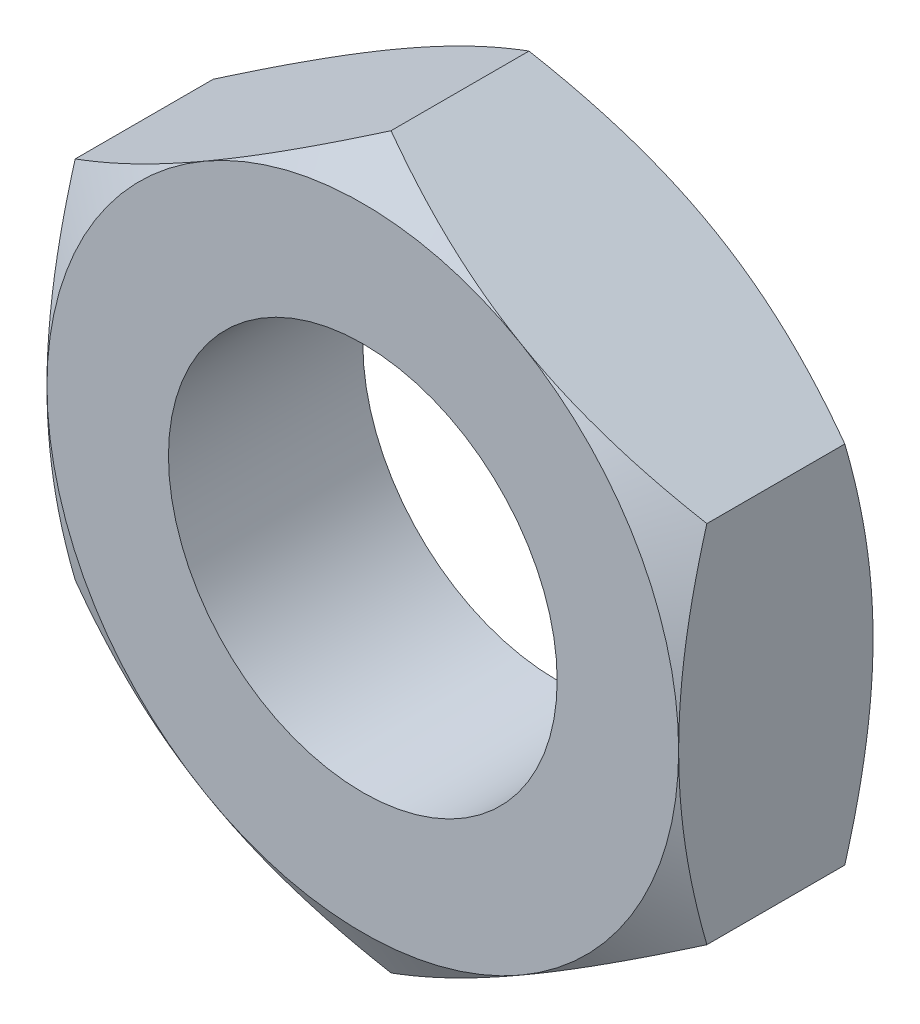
from build123d import *

# Parameters (mm, degrees)
BASE_EXTRUSION_DEPTH    = 4
ESQUISSE3_R             = 4
ENL_V_MAT_EXTRU_1_DEPTH = 11.704360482


with BuildPart() as part:
    # Esquisse1 → Base-Extrusion (new body)
    with BuildSketch(Plane.XY):
        Polygon((6.5, -3.75277675), (6.5, 3.75277675), (0, 7.505553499), (-6.5, 3.75277675), (-6.5, -3.75277675), (0, -7.505553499), align=None)
    extrude(amount=-BASE_EXTRUSION_DEPTH)

    # Esquisse2 → Enl_vement de mati_re-R_volution1 (revolve, cut)
    with BuildSketch(Plane(origin=(0, 0, 0), x_dir=(1, 0, 0), z_dir=(0, 1, 0)), mode=Mode.PRIVATE) as enl_vement_de_mati_re_r_volution1_sk:
        Polygon((-6.5, 0), (-10.964101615, 0), (-10.964101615, 4), (-6.5, 4), (-9.964101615, 2), align=None)
    revolve(enl_vement_de_mati_re_r_volution1_sk.sketch.rotate(Axis((0, 0, -4), (0, 0, 1)), 180), axis=Axis((0, 0, -4), (0, 0, 1)), mode=Mode.SUBTRACT)

    # Esquisse3 → Enl_v. mat.-Extru.1 (cut, through all)
    with BuildSketch(Plane.XY):
        Circle(ESQUISSE3_R)
    extrude(amount=-ENL_V_MAT_EXTRU_1_DEPTH, mode=Mode.SUBTRACT)


solid = part.part
